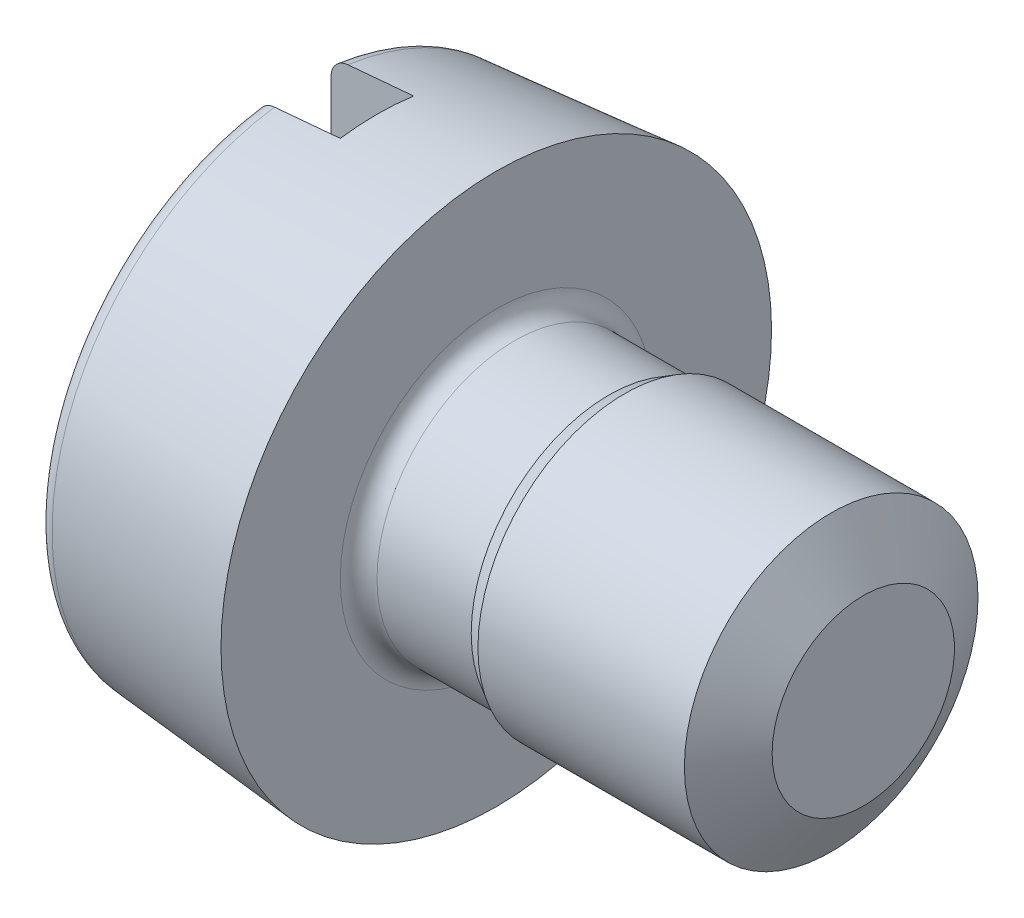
from build123d import *

# Parameters (mm, degrees)
CUT_EXTRUDE_1_DEPTH = 0.45


with BuildPart() as part:
    # Sketch 1 → Revolve 654 (revolve)
    with BuildSketch(Plane.XY, mode=Mode.PRIVATE) as revolve_654_sk:
        with BuildLine():
            Line((0, 0), (0, 1.312129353))
            ThreePointArc((0, 1.312129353), (0.026272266, 1.379688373), (0.091284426, 1.411748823))
            Line((0.091284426, 1.411748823), (1.1, 1.5))
            Line((1.1, 1.5), (1.1, 0.85))
            ThreePointArc((1.1, 0.85), (1.129289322, 0.779289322), (1.2, 0.75))
            Line((1.2, 0.75), (1.71339746, 0.75))
            Line((1.71339746, 0.75), (1.8, 0.8))
            Line((1.8, 0.8), (3.1, 0.8))
            Line((3.1, 0.8), (3.1, 0))
            Line((3.1, 0), (0, 0))
        make_face()
    revolve(revolve_654_sk.sketch.rotate(Axis((0, 0, 0), (1, 0, 0)), 90), axis=Axis((0, 0, 0), (1, 0, 0)))

    # Sketch 2 → Cut-Extrude 1 (cut)
    with BuildSketch(Plane.ZY):
        with BuildLine():
            Line((0.2, 1.486606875), (0.2, -1.486606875))
            ThreePointArc((0.2, -1.486606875), (0, -1.5), (-0.2, -1.486606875))
            Line((-0.2, -1.486606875), (-0.2, 1.486606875))
            ThreePointArc((-0.2, 1.486606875), (0, 1.5), (0.2, 1.486606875))
        make_face()
    extrude(amount=-CUT_EXTRUDE_1_DEPTH, mode=Mode.SUBTRACT)

    # Sketch 3 → Cut-Revolve 1 (revolve, cut)
    with BuildSketch(Plane(origin=(0, 0, 0), x_dir=(1, 0, 0), z_dir=(0, 1, 0)), mode=Mode.PRIVATE) as cut_revolve_1_sk:
        Polygon((2.925005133, 0.8), (3.274994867, 0.8), (3.1, 0.4969), align=None)
    revolve(cut_revolve_1_sk.sketch.rotate(Axis((0, 0, 0), (1, 0, 0)), 180), axis=Axis((0, 0, 0), (1, 0, 0)), mode=Mode.SUBTRACT)


solid = part.part
